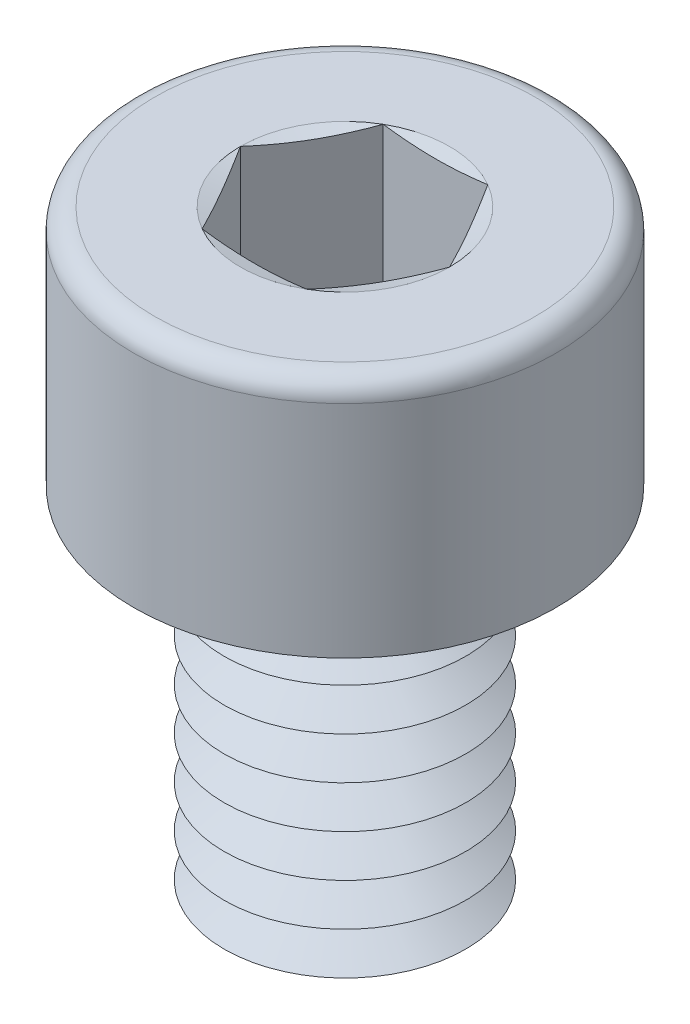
ISO-10303-21;
HEADER;
FILE_DESCRIPTION(('STEP AP214'),'2;1');
FILE_NAME('part.step','',(''),(''),'','','');
FILE_SCHEMA(('AUTOMOTIVE_DESIGN { 1 0 10303 214 1 1 1 1 }'));
ENDSEC;
DATA;
#1=APPLICATION_CONTEXT('core data for automotive mechanical design processes');
#2=APPLICATION_PROTOCOL_DEFINITION('international standard','automotive_design',2000,#1);
#3=PRODUCT_CONTEXT('',#1,'mechanical');
#4=PRODUCT('Part','Part','',(#3));
#5=PRODUCT_RELATED_PRODUCT_CATEGORY('part','',(#4));
#6=PRODUCT_DEFINITION_FORMATION('','',#4);
#7=PRODUCT_DEFINITION_CONTEXT('part definition',#1,'design');
#8=PRODUCT_DEFINITION('design','',#6,#7);
#9=PRODUCT_DEFINITION_SHAPE('','',#8);
#10=(LENGTH_UNIT() NAMED_UNIT(*) SI_UNIT(.MILLI.,.METRE.));
#11=(NAMED_UNIT(*) PLANE_ANGLE_UNIT() SI_UNIT($,.RADIAN.));
#12=(NAMED_UNIT(*) SI_UNIT($,.STERADIAN.) SOLID_ANGLE_UNIT());
#13=UNCERTAINTY_MEASURE_WITH_UNIT(LENGTH_MEASURE(1.E-05),#10,'distance_accuracy_value','');
#14=(GEOMETRIC_REPRESENTATION_CONTEXT(3) GLOBAL_UNCERTAINTY_ASSIGNED_CONTEXT((#13)) GLOBAL_UNIT_ASSIGNED_CONTEXT((#10,
#11,#12)) REPRESENTATION_CONTEXT('',''));
#15=CARTESIAN_POINT('',(0.,0.,0.));
#16=DIRECTION('',(0.,0.,1.));
#17=DIRECTION('',(1.,0.,0.));
#18=AXIS2_PLACEMENT_3D('',#15,#16,#17);
#19=CARTESIAN_POINT('',(0.,2.8,0.));
#20=DIRECTION('',(0.,1.,0.));
#21=DIRECTION('',(0.,0.,1.));
#22=AXIS2_PLACEMENT_3D('',#19,#20,#21);
#23=CONICAL_SURFACE('',#22,1.39378221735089,1.0471975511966);
#24=CARTESIAN_POINT('',(0.,3.15,0.));
#25=DIRECTION('',(0.,1.,0.));
#26=DIRECTION('',(0.,0.,1.));
#27=AXIS2_PLACEMENT_3D('',#24,#25,#26);
#28=CIRCLE('',#27,2.);
#29=CARTESIAN_POINT('',(0.,3.15,2.));
#30=VERTEX_POINT('',#29);
#31=EDGE_CURVE('E383',#30,#30,#28,.T.);
#32=ORIENTED_EDGE('',*,*,#31,.F.);
#33=EDGE_LOOP('',(#32));
#34=FACE_BOUND('',#33,.T.);
#35=CARTESIAN_POINT('',(0.,2.8,0.));
#36=DIRECTION('',(0.,1.,0.));
#37=DIRECTION('',(0.,0.,1.));
#38=AXIS2_PLACEMENT_3D('',#35,#36,#37);
#39=CIRCLE('',#38,1.39378221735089);
#40=CARTESIAN_POINT('',(0.,2.8,1.39378221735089));
#41=VERTEX_POINT('',#40);
#42=EDGE_CURVE('E387',#41,#41,#39,.T.);
#43=ORIENTED_EDGE('',*,*,#42,.T.);
#44=EDGE_LOOP('',(#43));
#45=FACE_BOUND('',#44,.T.);
#46=ADVANCED_FACE('F41',(#34,#45),#23,.T.);
#47=CARTESIAN_POINT('',(0.,2.45,0.));
#48=DIRECTION('',(0.,-1.,0.));
#49=DIRECTION('',(0.,0.,-1.));
#50=AXIS2_PLACEMENT_3D('',#47,#48,#49);
#51=CONICAL_SURFACE('',#50,2.,1.0471975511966);
#52=ORIENTED_EDGE('',*,*,#42,.F.);
#53=EDGE_LOOP('',(#52));
#54=FACE_BOUND('',#53,.T.);
#55=CARTESIAN_POINT('',(0.,2.45,0.));
#56=DIRECTION('',(0.,1.,0.));
#57=DIRECTION('',(0.,0.,1.));
#58=AXIS2_PLACEMENT_3D('',#55,#56,#57);
#59=CIRCLE('',#58,2.);
#60=CARTESIAN_POINT('',(0.,2.45,2.));
#61=VERTEX_POINT('',#60);
#62=EDGE_CURVE('E391',#61,#61,#59,.T.);
#63=ORIENTED_EDGE('',*,*,#62,.T.);
#64=EDGE_LOOP('',(#63));
#65=FACE_BOUND('',#64,.T.);
#66=ADVANCED_FACE('F251',(#54,#65),#51,.T.);
#67=CARTESIAN_POINT('',(0.,0.,0.));
#68=DIRECTION('',(0.,1.,0.));
#69=DIRECTION('',(0.,0.,1.));
#70=AXIS2_PLACEMENT_3D('',#67,#68,#69);
#71=PLANE('',#70);
#72=CARTESIAN_POINT('',(0.,0.,0.));
#73=DIRECTION('',(0.,1.,0.));
#74=DIRECTION('',(0.,0.,1.));
#75=AXIS2_PLACEMENT_3D('',#72,#73,#74);
#76=CIRCLE('',#75,1.39378221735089);
#77=CARTESIAN_POINT('',(0.,0.,1.39378221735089));
#78=VERTEX_POINT('',#77);
#79=EDGE_CURVE('E418',#78,#78,#76,.T.);
#80=ORIENTED_EDGE('',*,*,#79,.F.);
#81=EDGE_LOOP('',(#80));
#82=FACE_BOUND('',#81,.T.);
#83=ADVANCED_FACE('F248',(#82),#71,.F.);
#84=CARTESIAN_POINT('',(0.,0.,0.));
#85=DIRECTION('',(0.,1.,0.));
#86=DIRECTION('',(0.,0.,1.));
#87=AXIS2_PLACEMENT_3D('',#84,#85,#86);
#88=CONICAL_SURFACE('',#87,1.39378221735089,1.0471975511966);
#89=CARTESIAN_POINT('',(0.,0.35,0.));
#90=DIRECTION('',(0.,1.,0.));
#91=DIRECTION('',(0.,0.,1.));
#92=AXIS2_PLACEMENT_3D('',#89,#90,#91);
#93=CIRCLE('',#92,2.);
#94=CARTESIAN_POINT('',(0.,0.35,2.));
#95=VERTEX_POINT('',#94);
#96=EDGE_CURVE('E414',#95,#95,#93,.T.);
#97=ORIENTED_EDGE('',*,*,#96,.F.);
#98=EDGE_LOOP('',(#97));
#99=FACE_BOUND('',#98,.T.);
#100=ORIENTED_EDGE('',*,*,#79,.T.);
#101=EDGE_LOOP('',(#100));
#102=FACE_BOUND('',#101,.T.);
#103=ADVANCED_FACE('F250',(#99,#102),#88,.T.);
#104=CARTESIAN_POINT('',(0.,0.35,0.));
#105=DIRECTION('',(0.,-1.,0.));
#106=DIRECTION('',(0.,0.,-1.));
#107=AXIS2_PLACEMENT_3D('',#104,#105,#106);
#108=CONICAL_SURFACE('',#107,2.,1.0471975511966);
#109=CARTESIAN_POINT('',(0.,0.7,0.));
#110=DIRECTION('',(0.,1.,0.));
#111=DIRECTION('',(0.,0.,1.));
#112=AXIS2_PLACEMENT_3D('',#109,#110,#111);
#113=CIRCLE('',#112,1.39378221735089);
#114=CARTESIAN_POINT('',(0.,0.7,1.39378221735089));
#115=VERTEX_POINT('',#114);
#116=EDGE_CURVE('E410',#115,#115,#113,.T.);
#117=ORIENTED_EDGE('',*,*,#116,.F.);
#118=EDGE_LOOP('',(#117));
#119=FACE_BOUND('',#118,.T.);
#120=ORIENTED_EDGE('',*,*,#96,.T.);
#121=EDGE_LOOP('',(#120));
#122=FACE_BOUND('',#121,.T.);
#123=ADVANCED_FACE('F291',(#119,#122),#108,.T.);
#124=CARTESIAN_POINT('',(0.,0.7,0.));
#125=DIRECTION('',(0.,1.,0.));
#126=DIRECTION('',(0.,0.,1.));
#127=AXIS2_PLACEMENT_3D('',#124,#125,#126);
#128=CONICAL_SURFACE('',#127,1.39378221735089,1.0471975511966);
#129=CARTESIAN_POINT('',(0.,1.05,0.));
#130=DIRECTION('',(0.,1.,0.));
#131=DIRECTION('',(0.,0.,1.));
#132=AXIS2_PLACEMENT_3D('',#129,#130,#131);
#133=CIRCLE('',#132,2.);
#134=CARTESIAN_POINT('',(0.,1.05,2.));
#135=VERTEX_POINT('',#134);
#136=EDGE_CURVE('E406',#135,#135,#133,.T.);
#137=ORIENTED_EDGE('',*,*,#136,.F.);
#138=EDGE_LOOP('',(#137));
#139=FACE_BOUND('',#138,.T.);
#140=ORIENTED_EDGE('',*,*,#116,.T.);
#141=EDGE_LOOP('',(#140));
#142=FACE_BOUND('',#141,.T.);
#143=ADVANCED_FACE('F286',(#139,#142),#128,.T.);
#144=CARTESIAN_POINT('',(0.,1.05,0.));
#145=DIRECTION('',(0.,-1.,0.));
#146=DIRECTION('',(0.,0.,-1.));
#147=AXIS2_PLACEMENT_3D('',#144,#145,#146);
#148=CONICAL_SURFACE('',#147,2.,1.0471975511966);
#149=CARTESIAN_POINT('',(0.,1.4,0.));
#150=DIRECTION('',(0.,1.,0.));
#151=DIRECTION('',(0.,0.,1.));
#152=AXIS2_PLACEMENT_3D('',#149,#150,#151);
#153=CIRCLE('',#152,1.39378221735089);
#154=CARTESIAN_POINT('',(0.,1.4,1.39378221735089));
#155=VERTEX_POINT('',#154);
#156=EDGE_CURVE('E402',#155,#155,#153,.T.);
#157=ORIENTED_EDGE('',*,*,#156,.F.);
#158=EDGE_LOOP('',(#157));
#159=FACE_BOUND('',#158,.T.);
#160=ORIENTED_EDGE('',*,*,#136,.T.);
#161=EDGE_LOOP('',(#160));
#162=FACE_BOUND('',#161,.T.);
#163=ADVANCED_FACE('F283',(#159,#162),#148,.T.);
#164=CARTESIAN_POINT('',(0.,1.4,0.));
#165=DIRECTION('',(0.,1.,0.));
#166=DIRECTION('',(0.,0.,1.));
#167=AXIS2_PLACEMENT_3D('',#164,#165,#166);
#168=CONICAL_SURFACE('',#167,1.39378221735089,1.0471975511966);
#169=CARTESIAN_POINT('',(0.,1.75,0.));
#170=DIRECTION('',(0.,1.,0.));
#171=DIRECTION('',(0.,0.,1.));
#172=AXIS2_PLACEMENT_3D('',#169,#170,#171);
#173=CIRCLE('',#172,2.);
#174=CARTESIAN_POINT('',(0.,1.75,2.));
#175=VERTEX_POINT('',#174);
#176=EDGE_CURVE('E398',#175,#175,#173,.T.);
#177=ORIENTED_EDGE('',*,*,#176,.F.);
#178=EDGE_LOOP('',(#177));
#179=FACE_BOUND('',#178,.T.);
#180=ORIENTED_EDGE('',*,*,#156,.T.);
#181=EDGE_LOOP('',(#180));
#182=FACE_BOUND('',#181,.T.);
#183=ADVANCED_FACE('F277',(#179,#182),#168,.T.);
#184=CARTESIAN_POINT('',(0.,1.75,0.));
#185=DIRECTION('',(0.,-1.,0.));
#186=DIRECTION('',(0.,0.,-1.));
#187=AXIS2_PLACEMENT_3D('',#184,#185,#186);
#188=CONICAL_SURFACE('',#187,2.,1.0471975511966);
#189=CARTESIAN_POINT('',(0.,2.1,0.));
#190=DIRECTION('',(0.,1.,0.));
#191=DIRECTION('',(0.,0.,1.));
#192=AXIS2_PLACEMENT_3D('',#189,#190,#191);
#193=CIRCLE('',#192,1.39378221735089);
#194=CARTESIAN_POINT('',(0.,2.1,1.39378221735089));
#195=VERTEX_POINT('',#194);
#196=EDGE_CURVE('E394',#195,#195,#193,.T.);
#197=ORIENTED_EDGE('',*,*,#196,.F.);
#198=EDGE_LOOP('',(#197));
#199=FACE_BOUND('',#198,.T.);
#200=ORIENTED_EDGE('',*,*,#176,.T.);
#201=EDGE_LOOP('',(#200));
#202=FACE_BOUND('',#201,.T.);
#203=ADVANCED_FACE('F273',(#199,#202),#188,.T.);
#204=CARTESIAN_POINT('',(0.,2.1,0.));
#205=DIRECTION('',(0.,1.,0.));
#206=DIRECTION('',(0.,0.,1.));
#207=AXIS2_PLACEMENT_3D('',#204,#205,#206);
#208=CONICAL_SURFACE('',#207,1.39378221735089,1.0471975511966);
#209=ORIENTED_EDGE('',*,*,#62,.F.);
#210=EDGE_LOOP('',(#209));
#211=FACE_BOUND('',#210,.T.);
#212=ORIENTED_EDGE('',*,*,#196,.T.);
#213=EDGE_LOOP('',(#212));
#214=FACE_BOUND('',#213,.T.);
#215=ADVANCED_FACE('F276',(#211,#214),#208,.T.);
#216=CARTESIAN_POINT('',(0.,3.5,0.));
#217=DIRECTION('',(0.,1.,0.));
#218=DIRECTION('',(0.,0.,1.));
#219=AXIS2_PLACEMENT_3D('',#216,#217,#218);
#220=CONICAL_SURFACE('',#219,1.39378221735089,1.0471975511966);
#221=CARTESIAN_POINT('',(0.,3.85,0.));
#222=DIRECTION('',(0.,1.,0.));
#223=DIRECTION('',(0.,0.,1.));
#224=AXIS2_PLACEMENT_3D('',#221,#222,#223);
#225=CIRCLE('',#224,2.);
#226=CARTESIAN_POINT('',(0.,3.85,2.));
#227=VERTEX_POINT('',#226);
#228=EDGE_CURVE('E375',#227,#227,#225,.T.);
#229=ORIENTED_EDGE('',*,*,#228,.F.);
#230=EDGE_LOOP('',(#229));
#231=FACE_BOUND('',#230,.T.);
#232=CARTESIAN_POINT('',(0.,3.5,0.));
#233=DIRECTION('',(0.,1.,0.));
#234=DIRECTION('',(0.,0.,1.));
#235=AXIS2_PLACEMENT_3D('',#232,#233,#234);
#236=CIRCLE('',#235,1.39378221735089);
#237=CARTESIAN_POINT('',(0.,3.5,1.39378221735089));
#238=VERTEX_POINT('',#237);
#239=EDGE_CURVE('E379',#238,#238,#236,.T.);
#240=ORIENTED_EDGE('',*,*,#239,.T.);
#241=EDGE_LOOP('',(#240));
#242=FACE_BOUND('',#241,.T.);
#243=ADVANCED_FACE('F281',(#231,#242),#220,.T.);
#244=CARTESIAN_POINT('',(0.,3.15,0.));
#245=DIRECTION('',(0.,-1.,0.));
#246=DIRECTION('',(0.,0.,-1.));
#247=AXIS2_PLACEMENT_3D('',#244,#245,#246);
#248=CONICAL_SURFACE('',#247,2.,1.0471975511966);
#249=ORIENTED_EDGE('',*,*,#239,.F.);
#250=EDGE_LOOP('',(#249));
#251=FACE_BOUND('',#250,.T.);
#252=ORIENTED_EDGE('',*,*,#31,.T.);
#253=EDGE_LOOP('',(#252));
#254=FACE_BOUND('',#253,.T.);
#255=ADVANCED_FACE('F619',(#251,#254),#248,.T.);
#256=CARTESIAN_POINT('',(0.,4.2,0.));
#257=DIRECTION('',(0.,1.,0.));
#258=DIRECTION('',(0.,0.,1.));
#259=AXIS2_PLACEMENT_3D('',#256,#257,#258);
#260=CONICAL_SURFACE('',#259,1.39378221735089,1.0471975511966);
#261=CARTESIAN_POINT('',(0.,4.55,0.));
#262=DIRECTION('',(0.,1.,0.));
#263=DIRECTION('',(0.,0.,1.));
#264=AXIS2_PLACEMENT_3D('',#261,#262,#263);
#265=CIRCLE('',#264,2.);
#266=CARTESIAN_POINT('',(0.,4.55,2.));
#267=VERTEX_POINT('',#266);
#268=EDGE_CURVE('E367',#267,#267,#265,.T.);
#269=ORIENTED_EDGE('',*,*,#268,.F.);
#270=EDGE_LOOP('',(#269));
#271=FACE_BOUND('',#270,.T.);
#272=CARTESIAN_POINT('',(0.,4.2,0.));
#273=DIRECTION('',(0.,1.,0.));
#274=DIRECTION('',(0.,0.,1.));
#275=AXIS2_PLACEMENT_3D('',#272,#273,#274);
#276=CIRCLE('',#275,1.39378221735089);
#277=CARTESIAN_POINT('',(0.,4.2,1.39378221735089));
#278=VERTEX_POINT('',#277);
#279=EDGE_CURVE('E371',#278,#278,#276,.T.);
#280=ORIENTED_EDGE('',*,*,#279,.T.);
#281=EDGE_LOOP('',(#280));
#282=FACE_BOUND('',#281,.T.);
#283=ADVANCED_FACE('F610',(#271,#282),#260,.T.);
#284=CARTESIAN_POINT('',(0.,3.85,0.));
#285=DIRECTION('',(0.,-1.,0.));
#286=DIRECTION('',(0.,0.,-1.));
#287=AXIS2_PLACEMENT_3D('',#284,#285,#286);
#288=CONICAL_SURFACE('',#287,2.,1.0471975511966);
#289=ORIENTED_EDGE('',*,*,#279,.F.);
#290=EDGE_LOOP('',(#289));
#291=FACE_BOUND('',#290,.T.);
#292=ORIENTED_EDGE('',*,*,#228,.T.);
#293=EDGE_LOOP('',(#292));
#294=FACE_BOUND('',#293,.T.);
#295=ADVANCED_FACE('F601',(#291,#294),#288,.T.);
#296=CARTESIAN_POINT('',(0.,4.9,0.));
#297=DIRECTION('',(0.,1.,0.));
#298=DIRECTION('',(0.,0.,1.));
#299=AXIS2_PLACEMENT_3D('',#296,#297,#298);
#300=CONICAL_SURFACE('',#299,1.39378221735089,1.0471975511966);
#301=CARTESIAN_POINT('',(0.,5.25,0.));
#302=DIRECTION('',(0.,1.,0.));
#303=DIRECTION('',(0.,0.,1.));
#304=AXIS2_PLACEMENT_3D('',#301,#302,#303);
#305=CIRCLE('',#304,2.);
#306=CARTESIAN_POINT('',(0.,5.25,2.));
#307=VERTEX_POINT('',#306);
#308=EDGE_CURVE('E353',#307,#307,#305,.T.);
#309=ORIENTED_EDGE('',*,*,#308,.F.);
#310=EDGE_LOOP('',(#309));
#311=FACE_BOUND('',#310,.T.);
#312=CARTESIAN_POINT('',(0.,4.9,0.));
#313=DIRECTION('',(0.,1.,0.));
#314=DIRECTION('',(0.,0.,1.));
#315=AXIS2_PLACEMENT_3D('',#312,#313,#314);
#316=CIRCLE('',#315,1.39378221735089);
#317=CARTESIAN_POINT('',(0.,4.9,1.39378221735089));
#318=VERTEX_POINT('',#317);
#319=EDGE_CURVE('E363',#318,#318,#316,.T.);
#320=ORIENTED_EDGE('',*,*,#319,.T.);
#321=EDGE_LOOP('',(#320));
#322=FACE_BOUND('',#321,.T.);
#323=ADVANCED_FACE('F592',(#311,#322),#300,.T.);
#324=CARTESIAN_POINT('',(0.,4.55,0.));
#325=DIRECTION('',(0.,-1.,0.));
#326=DIRECTION('',(0.,0.,-1.));
#327=AXIS2_PLACEMENT_3D('',#324,#325,#326);
#328=CONICAL_SURFACE('',#327,2.,1.0471975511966);
#329=ORIENTED_EDGE('',*,*,#319,.F.);
#330=EDGE_LOOP('',(#329));
#331=FACE_BOUND('',#330,.T.);
#332=ORIENTED_EDGE('',*,*,#268,.T.);
#333=EDGE_LOOP('',(#332));
#334=FACE_BOUND('',#333,.T.);
#335=ADVANCED_FACE('F584',(#331,#334),#328,.T.);
#336=CARTESIAN_POINT('',(0.,5.6,0.));
#337=DIRECTION('',(0.,1.,0.));
#338=DIRECTION('',(0.,0.,1.));
#339=AXIS2_PLACEMENT_3D('',#336,#337,#338);
#340=CONICAL_SURFACE('',#339,1.39378221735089,1.0471975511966);
#341=CARTESIAN_POINT('',(0.,5.95,0.));
#342=DIRECTION('',(0.,1.,0.));
#343=DIRECTION('',(0.,0.,1.));
#344=AXIS2_PLACEMENT_3D('',#341,#342,#343);
#345=CIRCLE('',#344,2.);
#346=CARTESIAN_POINT('',(0.,5.95,2.));
#347=VERTEX_POINT('',#346);
#348=EDGE_CURVE('E358',#347,#347,#345,.T.);
#349=ORIENTED_EDGE('',*,*,#348,.F.);
#350=EDGE_LOOP('',(#349));
#351=FACE_BOUND('',#350,.T.);
#352=CARTESIAN_POINT('',(0.,5.6,0.));
#353=DIRECTION('',(0.,1.,0.));
#354=DIRECTION('',(0.,0.,1.));
#355=AXIS2_PLACEMENT_3D('',#352,#353,#354);
#356=CIRCLE('',#355,1.39378221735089);
#357=CARTESIAN_POINT('',(0.,5.6,1.39378221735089));
#358=VERTEX_POINT('',#357);
#359=EDGE_CURVE('E348',#358,#358,#356,.T.);
#360=ORIENTED_EDGE('',*,*,#359,.T.);
#361=EDGE_LOOP('',(#360));
#362=FACE_BOUND('',#361,.T.);
#363=ADVANCED_FACE('F576',(#351,#362),#340,.T.);
#364=CARTESIAN_POINT('',(0.,5.25,0.));
#365=DIRECTION('',(0.,-1.,0.));
#366=DIRECTION('',(0.,0.,-1.));
#367=AXIS2_PLACEMENT_3D('',#364,#365,#366);
#368=CONICAL_SURFACE('',#367,2.,1.0471975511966);
#369=ORIENTED_EDGE('',*,*,#359,.F.);
#370=EDGE_LOOP('',(#369));
#371=FACE_BOUND('',#370,.T.);
#372=ORIENTED_EDGE('',*,*,#308,.T.);
#373=EDGE_LOOP('',(#372));
#374=FACE_BOUND('',#373,.T.);
#375=ADVANCED_FACE('F195',(#371,#374),#368,.T.);
#376=CARTESIAN_POINT('',(0.,10.,0.));
#377=DIRECTION('',(0.,1.,0.));
#378=DIRECTION('',(0.,0.,1.));
#379=AXIS2_PLACEMENT_3D('',#376,#377,#378);
#380=PLANE('',#379);
#381=CARTESIAN_POINT('',(0.,10.,0.));
#382=DIRECTION('',(0.,1.,0.));
#383=DIRECTION('',(0.,0.,1.));
#384=AXIS2_PLACEMENT_3D('',#381,#382,#383);
#385=CIRCLE('',#384,1.73205080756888);
#386=CARTESIAN_POINT('',(0.866025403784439,10.,1.5));
#387=VERTEX_POINT('',#386);
#388=CARTESIAN_POINT('',(1.73205080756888,10.,0.));
#389=VERTEX_POINT('',#388);
#390=EDGE_CURVE('E121',#387,#389,#385,.T.);
#391=ORIENTED_EDGE('',*,*,#390,.F.);
#392=CARTESIAN_POINT('',(0.,10.,0.));
#393=DIRECTION('',(0.,1.,0.));
#394=DIRECTION('',(0.,0.,1.));
#395=AXIS2_PLACEMENT_3D('',#392,#393,#394);
#396=CIRCLE('',#395,1.73205080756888);
#397=CARTESIAN_POINT('',(-0.866025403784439,10.,1.5));
#398=VERTEX_POINT('',#397);
#399=EDGE_CURVE('E45',#398,#387,#396,.T.);
#400=ORIENTED_EDGE('',*,*,#399,.F.);
#401=CARTESIAN_POINT('',(-1.73205080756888,10.,0.));
#402=VERTEX_POINT('',#401);
#403=EDGE_CURVE('E138',#402,#398,#396,.T.);
#404=ORIENTED_EDGE('',*,*,#403,.F.);
#405=CARTESIAN_POINT('',(-0.866025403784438,10.,-1.5));
#406=VERTEX_POINT('',#405);
#407=EDGE_CURVE('E848',#406,#402,#396,.T.);
#408=ORIENTED_EDGE('',*,*,#407,.F.);
#409=CARTESIAN_POINT('',(0.866025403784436,10.,-1.5));
#410=VERTEX_POINT('',#409);
#411=EDGE_CURVE('E51',#410,#406,#396,.T.);
#412=ORIENTED_EDGE('',*,*,#411,.F.);
#413=EDGE_CURVE('E11',#389,#410,#396,.T.);
#414=ORIENTED_EDGE('',*,*,#413,.F.);
#415=EDGE_LOOP('',(#391,#400,#404,#408,#412,#414));
#416=FACE_BOUND('',#415,.T.);
#417=CARTESIAN_POINT('',(0.,10.,0.));
#418=DIRECTION('',(0.,1.,0.));
#419=DIRECTION('',(0.,0.,1.));
#420=AXIS2_PLACEMENT_3D('',#417,#418,#419);
#421=CIRCLE('',#420,3.15);
#422=CARTESIAN_POINT('',(0.,10.,3.15));
#423=VERTEX_POINT('',#422);
#424=EDGE_CURVE('E462',#423,#423,#421,.T.);
#425=ORIENTED_EDGE('',*,*,#424,.T.);
#426=EDGE_LOOP('',(#425));
#427=FACE_BOUND('',#426,.T.);
#428=ADVANCED_FACE('F140',(#416,#427),#380,.T.);
#429=CARTESIAN_POINT('',(0.,9.65,0.));
#430=DIRECTION('',(0.,1.,0.));
#431=DIRECTION('',(0.,0.,1.));
#432=AXIS2_PLACEMENT_3D('',#429,#430,#431);
#433=TOROIDAL_SURFACE('',#432,3.15,0.35);
#434=CARTESIAN_POINT('',(0.,9.65,0.));
#435=DIRECTION('',(0.,1.,0.));
#436=DIRECTION('',(0.,0.,1.));
#437=AXIS2_PLACEMENT_3D('',#434,#435,#436);
#438=CIRCLE('',#437,3.5);
#439=CARTESIAN_POINT('',(0.,9.65,3.5));
#440=VERTEX_POINT('',#439);
#441=EDGE_CURVE('E466',#440,#440,#438,.F.);
#442=ORIENTED_EDGE('',*,*,#441,.F.);
#443=EDGE_LOOP('',(#442));
#444=FACE_BOUND('',#443,.T.);
#445=ORIENTED_EDGE('',*,*,#424,.F.);
#446=EDGE_LOOP('',(#445));
#447=FACE_BOUND('',#446,.T.);
#448=ADVANCED_FACE('F43',(#444,#447),#433,.T.);
#449=CARTESIAN_POINT('',(0.,10.,0.));
#450=DIRECTION('',(0.,-1.,0.));
#451=DIRECTION('',(0.,0.,-1.));
#452=AXIS2_PLACEMENT_3D('',#449,#450,#451);
#453=CYLINDRICAL_SURFACE('',#452,3.5);
#454=ORIENTED_EDGE('',*,*,#441,.T.);
#455=EDGE_LOOP('',(#454));
#456=FACE_BOUND('',#455,.T.);
#457=CARTESIAN_POINT('',(0.,6.,0.));
#458=DIRECTION('',(0.,1.,0.));
#459=DIRECTION('',(0.,0.,1.));
#460=AXIS2_PLACEMENT_3D('',#457,#458,#459);
#461=CIRCLE('',#460,3.5);
#462=CARTESIAN_POINT('',(0.,6.,3.5));
#463=VERTEX_POINT('',#462);
#464=EDGE_CURVE('E449',#463,#463,#461,.T.);
#465=ORIENTED_EDGE('',*,*,#464,.T.);
#466=EDGE_LOOP('',(#465));
#467=FACE_BOUND('',#466,.T.);
#468=ADVANCED_FACE('F243',(#456,#467),#453,.T.);
#469=CARTESIAN_POINT('',(0.,6.,0.));
#470=DIRECTION('',(0.,1.,0.));
#471=DIRECTION('',(0.,0.,1.));
#472=AXIS2_PLACEMENT_3D('',#469,#470,#471);
#473=PLANE('',#472);
#474=ORIENTED_EDGE('',*,*,#464,.F.);
#475=EDGE_LOOP('',(#474));
#476=FACE_BOUND('',#475,.T.);
#477=CARTESIAN_POINT('',(0.,6.,0.));
#478=DIRECTION('',(0.,1.,0.));
#479=DIRECTION('',(0.,0.,1.));
#480=AXIS2_PLACEMENT_3D('',#477,#478,#479);
#481=CIRCLE('',#480,2.);
#482=CARTESIAN_POINT('',(0.,6.,2.));
#483=VERTEX_POINT('',#482);
#484=EDGE_CURVE('E458',#483,#483,#481,.T.);
#485=ORIENTED_EDGE('',*,*,#484,.T.);
#486=EDGE_LOOP('',(#485));
#487=FACE_BOUND('',#486,.T.);
#488=ADVANCED_FACE('F239',(#476,#487),#473,.F.);
#489=CARTESIAN_POINT('',(0.,6.,0.));
#490=DIRECTION('',(0.,-1.,0.));
#491=DIRECTION('',(0.,0.,-1.));
#492=AXIS2_PLACEMENT_3D('',#489,#490,#491);
#493=CYLINDRICAL_SURFACE('',#492,2.);
#494=ORIENTED_EDGE('',*,*,#348,.T.);
#495=EDGE_LOOP('',(#494));
#496=FACE_BOUND('',#495,.T.);
#497=ORIENTED_EDGE('',*,*,#484,.F.);
#498=EDGE_LOOP('',(#497));
#499=FACE_BOUND('',#498,.T.);
#500=ADVANCED_FACE('F242',(#496,#499),#493,.T.);
#501=CARTESIAN_POINT('',(0.,10.,0.));
#502=DIRECTION('',(0.,1.,0.));
#503=DIRECTION('',(0.,0.,1.));
#504=AXIS2_PLACEMENT_3D('',#501,#502,#503);
#505=CONICAL_SURFACE('',#504,1.73205080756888,1.30899693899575);
#506=ORIENTED_EDGE('',*,*,#399,.T.);
#507=CARTESIAN_POINT('',(-2.26080568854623,10.2628876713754,1.5));
#508=CARTESIAN_POINT('',(-2.19307335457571,10.247767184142,1.5));
#509=CARTESIAN_POINT('',(-2.12529797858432,10.2328393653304,1.5));
#510=CARTESIAN_POINT('',(-1.98963961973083,10.203466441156,1.5));
#511=CARTESIAN_POINT('',(-1.92175663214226,10.1890213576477,1.5));
#512=CARTESIAN_POINT('',(-1.71778516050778,10.146529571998,1.5));
#513=CARTESIAN_POINT('',(-1.58151166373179,10.1193574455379,1.5));
#514=CARTESIAN_POINT('',(-1.30947840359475,10.0687885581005,1.5));
#515=CARTESIAN_POINT('',(-1.17372447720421,10.0453610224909,1.5));
#516=CARTESIAN_POINT('',(-0.901404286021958,10.0038503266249,1.5));
#517=CARTESIAN_POINT('',(-0.764838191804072,9.98576608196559,1.5));
#518=CARTESIAN_POINT('',(-0.48929318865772,9.95729203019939,1.5));
#519=CARTESIAN_POINT('',(-0.350304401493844,9.94699084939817,1.5));
#520=CARTESIAN_POINT('',(-0.141571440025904,9.93918165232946,1.5));
#521=CARTESIAN_POINT('',(-0.0719628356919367,9.93785196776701,1.5));
#522=CARTESIAN_POINT('',(0.0672555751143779,9.93779336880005,1.5));
#523=CARTESIAN_POINT('',(0.136865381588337,9.9390644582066,1.5));
#524=CARTESIAN_POINT('',(0.346114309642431,9.9467225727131,1.5));
#525=CARTESIAN_POINT('',(0.485619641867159,9.95697478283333,1.5));
#526=CARTESIAN_POINT('',(0.763829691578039,9.98560011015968,1.5));
#527=CARTESIAN_POINT('',(0.902533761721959,10.0039790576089,1.5));
#528=CARTESIAN_POINT('',(1.18270277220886,10.0467752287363,1.5));
#529=CARTESIAN_POINT('',(1.32414472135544,10.0713381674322,1.5));
#530=CARTESIAN_POINT('',(1.60634089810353,10.1241771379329,1.5));
#531=CARTESIAN_POINT('',(1.7470950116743,10.1524537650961,1.5));
#532=CARTESIAN_POINT('',(2.02813528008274,10.2114128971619,1.5));
#533=CARTESIAN_POINT('',(2.16842128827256,10.2420960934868,1.5));
#534=CARTESIAN_POINT('',(2.4486355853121,10.3050575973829,1.5));
#535=CARTESIAN_POINT('',(2.58856386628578,10.3373359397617,1.5));
#536=CARTESIAN_POINT('',(2.86645602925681,10.4025869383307,1.5));
#537=CARTESIAN_POINT('',(3.00442304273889,10.435546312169,1.5));
#538=CARTESIAN_POINT('',(3.28017563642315,10.5022271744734,1.5));
#539=CARTESIAN_POINT('',(3.41796121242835,10.5359486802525,1.5));
#540=CARTESIAN_POINT('',(3.69320305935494,10.6038996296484,1.5));
#541=CARTESIAN_POINT('',(3.83065952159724,10.6381282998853,1.5));
#542=CARTESIAN_POINT('',(4.10546119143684,10.7070087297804,1.5));
#543=CARTESIAN_POINT('',(4.24280640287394,10.7416604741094,1.5));
#544=CARTESIAN_POINT('',(4.38011382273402,10.7764596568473,1.5));
#545=B_SPLINE_CURVE_WITH_KNOTS('',3,(#507,#508,#509,#510,#511,#512,#513,#514,#515,#516,#517,
#518,#519,#520,#521,#522,#523,#524,#525,#526,#527,#528,#529,#530,#531,#532,#533,#534,#535,#536,
#537,#538,#539,#540,#541,#542,#543,#544),.UNSPECIFIED.,.F.,.F.,(4,2,2,2,2,2,2,2,2,2,2,2,2,2,2,2,
2,2,4),(0.,0.208198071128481,0.416405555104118,0.833243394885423,1.24645656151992,
1.65958581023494,2.07735129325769,2.28617008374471,2.49498918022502,2.91428402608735,
3.33388016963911,3.76448033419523,4.19514961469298,4.62594308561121,5.05674596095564,
5.48229088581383,5.90784548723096,6.33280701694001,6.75775319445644),.UNSPECIFIED.);
#546=EDGE_CURVE('E127',#398,#387,#545,.T.);
#547=ORIENTED_EDGE('',*,*,#546,.F.);
#548=EDGE_LOOP('',(#506,#547));
#549=FACE_BOUND('',#548,.T.);
#550=ADVANCED_FACE('F132',(#549),#505,.F.);
#551=ORIENTED_EDGE('',*,*,#403,.T.);
#552=CARTESIAN_POINT('',(-1.73216627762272,10.0000309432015,-0.000200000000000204));
#553=CARTESIAN_POINT('',(-1.69619286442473,9.99038632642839,0.0621077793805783));
#554=CARTESIAN_POINT('',(-1.66015421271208,9.98163049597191,0.124528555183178));
#555=CARTESIAN_POINT('',(-1.58794959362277,9.96624719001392,0.249590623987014));
#556=CARTESIAN_POINT('',(-1.55178358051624,9.9596205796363,0.312231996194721));
#557=CARTESIAN_POINT('',(-1.47954358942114,9.94888268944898,0.437355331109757));
#558=CARTESIAN_POINT('',(-1.44347010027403,9.94475860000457,0.499836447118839));
#559=CARTESIAN_POINT('',(-1.37127710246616,9.93922860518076,0.624878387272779));
#560=CARTESIAN_POINT('',(-1.33515760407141,9.93782217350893,0.687439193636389));
#561=CARTESIAN_POINT('',(-1.26291860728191,9.93782217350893,0.81256080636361));
#562=CARTESIAN_POINT('',(-1.22679910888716,9.93922860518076,0.87512161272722));
#563=CARTESIAN_POINT('',(-1.15460611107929,9.94475860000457,1.00016355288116));
#564=CARTESIAN_POINT('',(-1.11853262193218,9.94888268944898,1.06264466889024));
#565=CARTESIAN_POINT('',(-1.04629263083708,9.9596205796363,1.18776800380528));
#566=CARTESIAN_POINT('',(-1.01012661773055,9.96624719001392,1.25040937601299));
#567=CARTESIAN_POINT('',(-0.937921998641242,9.98163049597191,1.37547144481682));
#568=CARTESIAN_POINT('',(-0.901883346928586,9.99038632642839,1.43789222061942));
#569=CARTESIAN_POINT('',(-0.865909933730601,10.0000309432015,1.5002));
#570=B_SPLINE_CURVE_WITH_KNOTS('',3,(#552,#553,#554,#555,#556,#557,#558,#559,#560,#561,#562,
#563,#564,#565,#566,#567,#568,#569),.UNSPECIFIED.,.F.,.F.,(4,2,2,2,2,2,2,2,4),(0.,
0.217782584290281,0.435653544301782,0.652399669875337,0.869103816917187,1.08580796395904,
1.30255408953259,1.52042504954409,1.73820763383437),.UNSPECIFIED.);
#571=EDGE_CURVE('E163',#402,#398,#570,.T.);
#572=ORIENTED_EDGE('',*,*,#571,.F.);
#573=EDGE_LOOP('',(#551,#572));
#574=FACE_BOUND('',#573,.T.);
#575=ADVANCED_FACE('F258',(#574),#505,.F.);
#576=ORIENTED_EDGE('',*,*,#407,.T.);
#577=CARTESIAN_POINT('',(-0.865909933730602,10.0000309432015,-1.5002));
#578=CARTESIAN_POINT('',(-0.901883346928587,9.99038632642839,-1.43789222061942));
#579=CARTESIAN_POINT('',(-0.937921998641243,9.98163049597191,-1.37547144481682));
#580=CARTESIAN_POINT('',(-1.01012661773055,9.96624719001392,-1.25040937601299));
#581=CARTESIAN_POINT('',(-1.04629263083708,9.9596205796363,-1.18776800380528));
#582=CARTESIAN_POINT('',(-1.11853262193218,9.94888268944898,-1.06264466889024));
#583=CARTESIAN_POINT('',(-1.15460611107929,9.94475860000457,-1.00016355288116));
#584=CARTESIAN_POINT('',(-1.22679910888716,9.93922860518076,-0.875121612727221));
#585=CARTESIAN_POINT('',(-1.26291860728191,9.93782217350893,-0.81256080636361));
#586=CARTESIAN_POINT('',(-1.33515760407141,9.93782217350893,-0.687439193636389));
#587=CARTESIAN_POINT('',(-1.37127710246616,9.93922860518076,-0.624878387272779));
#588=CARTESIAN_POINT('',(-1.44347010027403,9.94475860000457,-0.499836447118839));
#589=CARTESIAN_POINT('',(-1.47954358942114,9.94888268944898,-0.437355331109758));
#590=CARTESIAN_POINT('',(-1.55178358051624,9.9596205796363,-0.312231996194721));
#591=CARTESIAN_POINT('',(-1.58794959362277,9.96624719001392,-0.249590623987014));
#592=CARTESIAN_POINT('',(-1.66015421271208,9.98163049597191,-0.124528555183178));
#593=CARTESIAN_POINT('',(-1.69619286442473,9.99038632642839,-0.0621077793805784));
#594=CARTESIAN_POINT('',(-1.73216627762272,10.0000309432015,0.000199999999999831));
#595=B_SPLINE_CURVE_WITH_KNOTS('',3,(#577,#578,#579,#580,#581,#582,#583,#584,#585,#586,#587,
#588,#589,#590,#591,#592,#593,#594),.UNSPECIFIED.,.F.,.F.,(4,2,2,2,2,2,2,2,4),(0.,
0.217782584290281,0.435653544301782,0.652399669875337,0.869103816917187,1.08580796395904,
1.30255408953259,1.52042504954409,1.73820763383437),.UNSPECIFIED.);
#596=EDGE_CURVE('E63',#406,#402,#595,.T.);
#597=ORIENTED_EDGE('',*,*,#596,.F.);
#598=EDGE_LOOP('',(#576,#597));
#599=FACE_BOUND('',#598,.T.);
#600=ADVANCED_FACE('F193',(#599),#505,.F.);
#601=ORIENTED_EDGE('',*,*,#411,.T.);
#602=CARTESIAN_POINT('',(-2.26080568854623,10.2628876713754,-1.5));
#603=CARTESIAN_POINT('',(-2.19307335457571,10.247767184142,-1.5));
#604=CARTESIAN_POINT('',(-2.12529797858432,10.2328393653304,-1.5));
#605=CARTESIAN_POINT('',(-1.98963961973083,10.203466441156,-1.5));
#606=CARTESIAN_POINT('',(-1.92175663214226,10.1890213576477,-1.5));
#607=CARTESIAN_POINT('',(-1.71778516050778,10.146529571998,-1.5));
#608=CARTESIAN_POINT('',(-1.58151166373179,10.1193574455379,-1.5));
#609=CARTESIAN_POINT('',(-1.30947840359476,10.0687885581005,-1.5));
#610=CARTESIAN_POINT('',(-1.17372447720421,10.0453610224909,-1.5));
#611=CARTESIAN_POINT('',(-0.901404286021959,10.0038503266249,-1.5));
#612=CARTESIAN_POINT('',(-0.764838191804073,9.98576608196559,-1.5));
#613=CARTESIAN_POINT('',(-0.489293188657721,9.95729203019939,-1.5));
#614=CARTESIAN_POINT('',(-0.350304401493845,9.94699084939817,-1.5));
#615=CARTESIAN_POINT('',(-0.141571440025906,9.93918165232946,-1.5));
#616=CARTESIAN_POINT('',(-0.0719628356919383,9.93785196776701,-1.5));
#617=CARTESIAN_POINT('',(0.0672555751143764,9.93779336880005,-1.5));
#618=CARTESIAN_POINT('',(0.136865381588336,9.9390644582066,-1.5));
#619=CARTESIAN_POINT('',(0.34611430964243,9.9467225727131,-1.5));
#620=CARTESIAN_POINT('',(0.485619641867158,9.95697478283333,-1.5));
#621=CARTESIAN_POINT('',(0.763829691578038,9.98560011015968,-1.5));
#622=CARTESIAN_POINT('',(0.902533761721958,10.0039790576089,-1.5));
#623=CARTESIAN_POINT('',(1.18270277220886,10.0467752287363,-1.5));
#624=CARTESIAN_POINT('',(1.32414472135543,10.0713381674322,-1.5));
#625=CARTESIAN_POINT('',(1.60634089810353,10.1241771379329,-1.5));
#626=CARTESIAN_POINT('',(1.7470950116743,10.1524537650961,-1.5));
#627=CARTESIAN_POINT('',(2.02813528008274,10.2114128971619,-1.5));
#628=CARTESIAN_POINT('',(2.16842128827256,10.2420960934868,-1.5));
#629=CARTESIAN_POINT('',(2.4486355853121,10.3050575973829,-1.5));
#630=CARTESIAN_POINT('',(2.58856386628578,10.3373359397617,-1.5));
#631=CARTESIAN_POINT('',(2.86645602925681,10.4025869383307,-1.5));
#632=CARTESIAN_POINT('',(3.00442304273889,10.435546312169,-1.5));
#633=CARTESIAN_POINT('',(3.28017563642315,10.5022271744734,-1.5));
#634=CARTESIAN_POINT('',(3.41796121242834,10.5359486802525,-1.5));
#635=CARTESIAN_POINT('',(3.69320305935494,10.6038996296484,-1.5));
#636=CARTESIAN_POINT('',(3.83065952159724,10.6381282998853,-1.5));
#637=CARTESIAN_POINT('',(4.10546119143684,10.7070087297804,-1.5));
#638=CARTESIAN_POINT('',(4.24280640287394,10.7416604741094,-1.5));
#639=CARTESIAN_POINT('',(4.38011382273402,10.7764596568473,-1.5));
#640=B_SPLINE_CURVE_WITH_KNOTS('',3,(#602,#603,#604,#605,#606,#607,#608,#609,#610,#611,#612,
#613,#614,#615,#616,#617,#618,#619,#620,#621,#622,#623,#624,#625,#626,#627,#628,#629,#630,#631,
#632,#633,#634,#635,#636,#637,#638,#639),.UNSPECIFIED.,.F.,.F.,(4,2,2,2,2,2,2,2,2,2,2,2,2,2,2,2,
2,2,4),(0.,0.20819807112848,0.416405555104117,0.833243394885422,1.24645656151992,
1.65958581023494,2.07735129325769,2.28617008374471,2.49498918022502,2.91428402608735,
3.33388016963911,3.76448033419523,4.19514961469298,4.62594308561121,5.05674596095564,
5.48229088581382,5.90784548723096,6.33280701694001,6.75775319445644),.UNSPECIFIED.);
#641=EDGE_CURVE('E214',#410,#406,#640,.F.);
#642=ORIENTED_EDGE('',*,*,#641,.F.);
#643=EDGE_LOOP('',(#601,#642));
#644=FACE_BOUND('',#643,.T.);
#645=ADVANCED_FACE('F188',(#644),#505,.F.);
#646=ORIENTED_EDGE('',*,*,#413,.T.);
#647=CARTESIAN_POINT('',(1.73216627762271,10.0000309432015,0.000200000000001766));
#648=CARTESIAN_POINT('',(1.69619286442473,9.99038632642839,-0.0621077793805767));
#649=CARTESIAN_POINT('',(1.66015421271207,9.98163049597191,-0.124528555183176));
#650=CARTESIAN_POINT('',(1.58794959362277,9.96624719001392,-0.249590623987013));
#651=CARTESIAN_POINT('',(1.55178358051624,9.9596205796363,-0.31223199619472));
#652=CARTESIAN_POINT('',(1.47954358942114,9.94888268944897,-0.437355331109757));
#653=CARTESIAN_POINT('',(1.44347010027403,9.94475860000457,-0.499836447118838));
#654=CARTESIAN_POINT('',(1.37127710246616,9.93922860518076,-0.624878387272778));
#655=CARTESIAN_POINT('',(1.33515760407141,9.93782217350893,-0.687439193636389));
#656=CARTESIAN_POINT('',(1.26291860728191,9.93782217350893,-0.81256080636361));
#657=CARTESIAN_POINT('',(1.22679910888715,9.93922860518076,-0.87512161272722));
#658=CARTESIAN_POINT('',(1.15460611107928,9.94475860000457,-1.00016355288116));
#659=CARTESIAN_POINT('',(1.11853262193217,9.94888268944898,-1.06264466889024));
#660=CARTESIAN_POINT('',(1.04629263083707,9.9596205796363,-1.18776800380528));
#661=CARTESIAN_POINT('',(1.01012661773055,9.96624719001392,-1.25040937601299));
#662=CARTESIAN_POINT('',(0.937921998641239,9.98163049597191,-1.37547144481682));
#663=CARTESIAN_POINT('',(0.901883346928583,9.99038632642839,-1.43789222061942));
#664=CARTESIAN_POINT('',(0.865909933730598,10.0000309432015,-1.5002));
#665=B_SPLINE_CURVE_WITH_KNOTS('',3,(#647,#648,#649,#650,#651,#652,#653,#654,#655,#656,#657,
#658,#659,#660,#661,#662,#663,#664),.UNSPECIFIED.,.F.,.F.,(4,2,2,2,2,2,2,2,4),(0.,
0.217782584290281,0.435653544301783,0.652399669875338,0.869103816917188,1.08580796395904,
1.30255408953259,1.52042504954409,1.73820763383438),.UNSPECIFIED.);
#666=EDGE_CURVE('E56',#389,#410,#665,.T.);
#667=ORIENTED_EDGE('',*,*,#666,.F.);
#668=EDGE_LOOP('',(#646,#667));
#669=FACE_BOUND('',#668,.T.);
#670=ADVANCED_FACE('F192',(#669),#505,.F.);
#671=ORIENTED_EDGE('',*,*,#390,.T.);
#672=CARTESIAN_POINT('',(0.865909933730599,10.0000309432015,1.5002));
#673=CARTESIAN_POINT('',(0.901883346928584,9.99038632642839,1.43789222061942));
#674=CARTESIAN_POINT('',(0.93792199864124,9.98163049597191,1.37547144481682));
#675=CARTESIAN_POINT('',(1.01012661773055,9.96624719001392,1.25040937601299));
#676=CARTESIAN_POINT('',(1.04629263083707,9.9596205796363,1.18776800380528));
#677=CARTESIAN_POINT('',(1.11853262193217,9.94888268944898,1.06264466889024));
#678=CARTESIAN_POINT('',(1.15460611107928,9.94475860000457,1.00016355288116));
#679=CARTESIAN_POINT('',(1.22679910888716,9.93922860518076,0.875121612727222));
#680=CARTESIAN_POINT('',(1.26291860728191,9.93782217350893,0.812560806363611));
#681=CARTESIAN_POINT('',(1.33515760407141,9.93782217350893,0.68743919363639));
#682=CARTESIAN_POINT('',(1.37127710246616,9.93922860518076,0.62487838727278));
#683=CARTESIAN_POINT('',(1.44347010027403,9.94475860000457,0.49983644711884));
#684=CARTESIAN_POINT('',(1.47954358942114,9.94888268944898,0.437355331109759));
#685=CARTESIAN_POINT('',(1.55178358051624,9.9596205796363,0.312231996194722));
#686=CARTESIAN_POINT('',(1.58794959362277,9.96624719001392,0.249590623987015));
#687=CARTESIAN_POINT('',(1.66015421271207,9.98163049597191,0.124528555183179));
#688=CARTESIAN_POINT('',(1.69619286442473,9.99038632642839,0.0621077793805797));
#689=CARTESIAN_POINT('',(1.73216627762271,10.0000309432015,-0.000199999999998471));
#690=B_SPLINE_CURVE_WITH_KNOTS('',3,(#672,#673,#674,#675,#676,#677,#678,#679,#680,#681,#682,
#683,#684,#685,#686,#687,#688,#689),.UNSPECIFIED.,.F.,.F.,(4,2,2,2,2,2,2,2,4),(0.,
0.217782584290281,0.435653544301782,0.652399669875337,0.869103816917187,1.08580796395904,
1.30255408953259,1.52042504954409,1.73820763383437),.UNSPECIFIED.);
#691=EDGE_CURVE('E117',#387,#389,#690,.T.);
#692=ORIENTED_EDGE('',*,*,#691,.F.);
#693=EDGE_LOOP('',(#671,#692));
#694=FACE_BOUND('',#693,.T.);
#695=ADVANCED_FACE('F119',(#694),#505,.F.);
#696=CARTESIAN_POINT('',(0.,7.,0.));
#697=DIRECTION('',(0.,1.,0.));
#698=DIRECTION('',(0.,0.,1.));
#699=AXIS2_PLACEMENT_3D('',#696,#697,#698);
#700=CONICAL_SURFACE('',#699,1.5,1.0471975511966);
#701=CARTESIAN_POINT('',(0.,6.13397459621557,0.));
#702=VERTEX_POINT('',#701);
#703=VERTEX_LOOP('',#702);
#704=FACE_BOUND('',#703,.T.);
#705=CARTESIAN_POINT('',(0.,7.,0.));
#706=DIRECTION('',(0.,1.,0.));
#707=DIRECTION('',(0.,0.,1.));
#708=AXIS2_PLACEMENT_3D('',#705,#706,#707);
#709=CIRCLE('',#708,1.5);
#710=CARTESIAN_POINT('',(0.,7.,1.5));
#711=VERTEX_POINT('',#710);
#712=CARTESIAN_POINT('',(1.29903810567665,7.,0.750000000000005));
#713=VERTEX_POINT('',#712);
#714=EDGE_CURVE('E422',#711,#713,#709,.T.);
#715=ORIENTED_EDGE('',*,*,#714,.T.);
#716=CARTESIAN_POINT('',(0.,7.,0.));
#717=DIRECTION('',(0.,1.,0.));
#718=DIRECTION('',(0.,0.,1.));
#719=AXIS2_PLACEMENT_3D('',#716,#717,#718);
#720=CIRCLE('',#719,1.49999999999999);
#721=CARTESIAN_POINT('',(1.29903810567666,7.,-0.749999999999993));
#722=VERTEX_POINT('',#721);
#723=EDGE_CURVE('E139',#713,#722,#720,.T.);
#724=ORIENTED_EDGE('',*,*,#723,.T.);
#725=CARTESIAN_POINT('',(0.,7.00000000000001,-1.5));
#726=VERTEX_POINT('',#725);
#727=EDGE_CURVE('E478',#722,#726,#720,.T.);
#728=ORIENTED_EDGE('',*,*,#727,.T.);
#729=CARTESIAN_POINT('',(-1.29903810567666,7.,-0.749999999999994));
#730=VERTEX_POINT('',#729);
#731=EDGE_CURVE('E476',#726,#730,#720,.T.);
#732=ORIENTED_EDGE('',*,*,#731,.T.);
#733=CARTESIAN_POINT('',(-1.29903810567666,7.,0.750000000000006));
#734=VERTEX_POINT('',#733);
#735=EDGE_CURVE('E471',#730,#734,#720,.T.);
#736=ORIENTED_EDGE('',*,*,#735,.T.);
#737=EDGE_CURVE('E469',#734,#711,#720,.T.);
#738=ORIENTED_EDGE('',*,*,#737,.T.);
#739=EDGE_LOOP('',(#715,#724,#728,#732,#736,#738));
#740=FACE_BOUND('',#739,.T.);
#741=ADVANCED_FACE('F301',(#704,#740),#700,.F.);
#742=CARTESIAN_POINT('',(0.866025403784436,7.,-1.5));
#743=DIRECTION('',(0.,1.,0.));
#744=DIRECTION('',(0.,0.,1.));
#745=AXIS2_PLACEMENT_3D('',#742,#743,#744);
#746=PLANE('',#745);
#747=ORIENTED_EDGE('',*,*,#731,.F.);
#748=DIRECTION('',(-1.,0.,0.));
#749=VECTOR('',#748,1.);
#750=CARTESIAN_POINT('',(0.866025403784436,7.,-1.5));
#751=LINE('',#750,#749);
#752=CARTESIAN_POINT('',(-0.86602540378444,7.,-1.5));
#753=VERTEX_POINT('',#752);
#754=EDGE_CURVE('E429',#726,#753,#751,.T.);
#755=ORIENTED_EDGE('',*,*,#754,.T.);
#756=DIRECTION('',(-0.5,0.,0.866025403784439));
#757=VECTOR('',#756,1.);
#758=CARTESIAN_POINT('',(-0.86602540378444,7.,-1.5));
#759=LINE('',#758,#757);
#760=EDGE_CURVE('E338',#753,#730,#759,.T.);
#761=ORIENTED_EDGE('',*,*,#760,.T.);
#762=EDGE_LOOP('',(#747,#755,#761));
#763=FACE_BOUND('',#762,.T.);
#764=ADVANCED_FACE('F304',(#763),#746,.T.);
#765=ORIENTED_EDGE('',*,*,#735,.F.);
#766=CARTESIAN_POINT('',(-1.73205080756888,7.,0.));
#767=VERTEX_POINT('',#766);
#768=EDGE_CURVE('E434',#730,#767,#759,.T.);
#769=ORIENTED_EDGE('',*,*,#768,.T.);
#770=DIRECTION('',(0.5,0.,0.866025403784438));
#771=VECTOR('',#770,1.);
#772=CARTESIAN_POINT('',(-1.73205080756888,7.,0.));
#773=LINE('',#772,#771);
#774=EDGE_CURVE('E328',#767,#734,#773,.T.);
#775=ORIENTED_EDGE('',*,*,#774,.T.);
#776=EDGE_LOOP('',(#765,#769,#775));
#777=FACE_BOUND('',#776,.T.);
#778=ADVANCED_FACE('F309',(#777),#746,.T.);
#779=ORIENTED_EDGE('',*,*,#737,.F.);
#780=CARTESIAN_POINT('',(-0.866025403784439,7.,1.5));
#781=VERTEX_POINT('',#780);
#782=EDGE_CURVE('E437',#734,#781,#773,.T.);
#783=ORIENTED_EDGE('',*,*,#782,.T.);
#784=DIRECTION('',(1.,0.,0.));
#785=VECTOR('',#784,1.);
#786=CARTESIAN_POINT('',(-0.866025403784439,7.,1.5));
#787=LINE('',#786,#785);
#788=EDGE_CURVE('E441',#781,#711,#787,.T.);
#789=ORIENTED_EDGE('',*,*,#788,.T.);
#790=EDGE_LOOP('',(#779,#783,#789));
#791=FACE_BOUND('',#790,.T.);
#792=ADVANCED_FACE('F306',(#791),#746,.T.);
#793=ORIENTED_EDGE('',*,*,#714,.F.);
#794=CARTESIAN_POINT('',(0.866025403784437,7.,1.5));
#795=VERTEX_POINT('',#794);
#796=EDGE_CURVE('E440',#711,#795,#787,.T.);
#797=ORIENTED_EDGE('',*,*,#796,.T.);
#798=DIRECTION('',(0.5,0.,-0.866025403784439));
#799=VECTOR('',#798,1.);
#800=CARTESIAN_POINT('',(0.866025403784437,7.,1.5));
#801=LINE('',#800,#799);
#802=EDGE_CURVE('E151',#795,#713,#801,.T.);
#803=ORIENTED_EDGE('',*,*,#802,.T.);
#804=EDGE_LOOP('',(#793,#797,#803));
#805=FACE_BOUND('',#804,.T.);
#806=ADVANCED_FACE('F308',(#805),#746,.T.);
#807=ORIENTED_EDGE('',*,*,#723,.F.);
#808=CARTESIAN_POINT('',(1.73205080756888,7.,0.));
#809=VERTEX_POINT('',#808);
#810=EDGE_CURVE('E445',#713,#809,#801,.T.);
#811=ORIENTED_EDGE('',*,*,#810,.T.);
#812=DIRECTION('',(-0.5,0.,-0.866025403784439));
#813=VECTOR('',#812,1.);
#814=CARTESIAN_POINT('',(1.73205080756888,7.,0.));
#815=LINE('',#814,#813);
#816=EDGE_CURVE('E425',#809,#722,#815,.T.);
#817=ORIENTED_EDGE('',*,*,#816,.T.);
#818=EDGE_LOOP('',(#807,#811,#817));
#819=FACE_BOUND('',#818,.T.);
#820=ADVANCED_FACE('F499',(#819),#746,.T.);
#821=ORIENTED_EDGE('',*,*,#727,.F.);
#822=CARTESIAN_POINT('',(0.866025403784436,7.,-1.5));
#823=VERTEX_POINT('',#822);
#824=EDGE_CURVE('E424',#722,#823,#815,.T.);
#825=ORIENTED_EDGE('',*,*,#824,.T.);
#826=EDGE_CURVE('E430',#823,#726,#751,.T.);
#827=ORIENTED_EDGE('',*,*,#826,.T.);
#828=EDGE_LOOP('',(#821,#825,#827));
#829=FACE_BOUND('',#828,.T.);
#830=ADVANCED_FACE('F235',(#829),#746,.T.);
#831=CARTESIAN_POINT('',(1.73205080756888,7.,0.));
#832=DIRECTION('',(0.866025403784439,0.,-0.5));
#833=DIRECTION('',(-0.5,0.,-0.866025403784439));
#834=AXIS2_PLACEMENT_3D('',#831,#832,#833);
#835=PLANE('',#834);
#836=DIRECTION('',(0.,1.,0.));
#837=VECTOR('',#836,1.);
#838=CARTESIAN_POINT('',(1.73205080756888,7.,0.));
#839=LINE('',#838,#837);
#840=EDGE_CURVE('E155',#809,#389,#839,.T.);
#841=ORIENTED_EDGE('',*,*,#840,.T.);
#842=ORIENTED_EDGE('',*,*,#666,.T.);
#843=DIRECTION('',(0.,1.,0.));
#844=VECTOR('',#843,1.);
#845=CARTESIAN_POINT('',(0.866025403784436,7.,-1.5));
#846=LINE('',#845,#844);
#847=EDGE_CURVE('E341',#823,#410,#846,.T.);
#848=ORIENTED_EDGE('',*,*,#847,.F.);
#849=ORIENTED_EDGE('',*,*,#824,.F.);
#850=ORIENTED_EDGE('',*,*,#816,.F.);
#851=EDGE_LOOP('',(#841,#842,#848,#849,#850));
#852=FACE_BOUND('',#851,.T.);
#853=ADVANCED_FACE('F231',(#852),#835,.F.);
#854=CARTESIAN_POINT('',(0.866025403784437,7.,1.5));
#855=DIRECTION('',(0.866025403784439,0.,0.5));
#856=DIRECTION('',(0.5,0.,-0.866025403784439));
#857=AXIS2_PLACEMENT_3D('',#854,#855,#856);
#858=PLANE('',#857);
#859=DIRECTION('',(0.,1.,0.));
#860=VECTOR('',#859,1.);
#861=CARTESIAN_POINT('',(0.866025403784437,7.,1.5));
#862=LINE('',#861,#860);
#863=EDGE_CURVE('E147',#795,#387,#862,.T.);
#864=ORIENTED_EDGE('',*,*,#863,.T.);
#865=ORIENTED_EDGE('',*,*,#691,.T.);
#866=ORIENTED_EDGE('',*,*,#840,.F.);
#867=ORIENTED_EDGE('',*,*,#810,.F.);
#868=ORIENTED_EDGE('',*,*,#802,.F.);
#869=EDGE_LOOP('',(#864,#865,#866,#867,#868));
#870=FACE_BOUND('',#869,.T.);
#871=ADVANCED_FACE('F148',(#870),#858,.F.);
#872=CARTESIAN_POINT('',(-0.866025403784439,7.,1.5));
#873=DIRECTION('',(0.,0.,1.));
#874=DIRECTION('',(1.,0.,0.));
#875=AXIS2_PLACEMENT_3D('',#872,#873,#874);
#876=PLANE('',#875);
#877=DIRECTION('',(0.,1.,0.));
#878=VECTOR('',#877,1.);
#879=CARTESIAN_POINT('',(-0.866025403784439,7.,1.5));
#880=LINE('',#879,#878);
#881=EDGE_CURVE('E156',#781,#398,#880,.T.);
#882=ORIENTED_EDGE('',*,*,#881,.T.);
#883=ORIENTED_EDGE('',*,*,#546,.T.);
#884=ORIENTED_EDGE('',*,*,#863,.F.);
#885=ORIENTED_EDGE('',*,*,#796,.F.);
#886=ORIENTED_EDGE('',*,*,#788,.F.);
#887=EDGE_LOOP('',(#882,#883,#884,#885,#886));
#888=FACE_BOUND('',#887,.T.);
#889=ADVANCED_FACE('F158',(#888),#876,.F.);
#890=CARTESIAN_POINT('',(-1.73205080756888,7.,0.));
#891=DIRECTION('',(-0.866025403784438,0.,0.5));
#892=DIRECTION('',(0.5,0.,0.866025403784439));
#893=AXIS2_PLACEMENT_3D('',#890,#891,#892);
#894=PLANE('',#893);
#895=DIRECTION('',(0.,1.,0.));
#896=VECTOR('',#895,1.);
#897=CARTESIAN_POINT('',(-1.73205080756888,7.,0.));
#898=LINE('',#897,#896);
#899=EDGE_CURVE('E325',#767,#402,#898,.T.);
#900=ORIENTED_EDGE('',*,*,#899,.T.);
#901=ORIENTED_EDGE('',*,*,#571,.T.);
#902=ORIENTED_EDGE('',*,*,#881,.F.);
#903=ORIENTED_EDGE('',*,*,#782,.F.);
#904=ORIENTED_EDGE('',*,*,#774,.F.);
#905=EDGE_LOOP('',(#900,#901,#902,#903,#904));
#906=FACE_BOUND('',#905,.T.);
#907=ADVANCED_FACE('F225',(#906),#894,.F.);
#908=CARTESIAN_POINT('',(-0.86602540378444,7.,-1.5));
#909=DIRECTION('',(-0.866025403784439,0.,-0.5));
#910=DIRECTION('',(-0.5,0.,0.866025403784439));
#911=AXIS2_PLACEMENT_3D('',#908,#909,#910);
#912=PLANE('',#911);
#913=DIRECTION('',(0.,1.,0.));
#914=VECTOR('',#913,1.);
#915=CARTESIAN_POINT('',(-0.86602540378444,7.,-1.5));
#916=LINE('',#915,#914);
#917=EDGE_CURVE('E331',#753,#406,#916,.T.);
#918=ORIENTED_EDGE('',*,*,#917,.T.);
#919=ORIENTED_EDGE('',*,*,#596,.T.);
#920=ORIENTED_EDGE('',*,*,#899,.F.);
#921=ORIENTED_EDGE('',*,*,#768,.F.);
#922=ORIENTED_EDGE('',*,*,#760,.F.);
#923=EDGE_LOOP('',(#918,#919,#920,#921,#922));
#924=FACE_BOUND('',#923,.T.);
#925=ADVANCED_FACE('F221',(#924),#912,.F.);
#926=CARTESIAN_POINT('',(0.866025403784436,7.,-1.5));
#927=DIRECTION('',(0.,0.,-1.));
#928=DIRECTION('',(-1.,0.,0.));
#929=AXIS2_PLACEMENT_3D('',#926,#927,#928);
#930=PLANE('',#929);
#931=ORIENTED_EDGE('',*,*,#847,.T.);
#932=ORIENTED_EDGE('',*,*,#641,.T.);
#933=ORIENTED_EDGE('',*,*,#917,.F.);
#934=ORIENTED_EDGE('',*,*,#754,.F.);
#935=ORIENTED_EDGE('',*,*,#826,.F.);
#936=EDGE_LOOP('',(#931,#932,#933,#934,#935));
#937=FACE_BOUND('',#936,.T.);
#938=ADVANCED_FACE('F224',(#937),#930,.F.);
#939=CLOSED_SHELL('',(#46,#66,#83,#103,#123,#143,#163,#183,#203,#215,#243,#255,#283,#295,#323,
#335,#363,#375,#428,#448,#468,#488,#500,#550,#575,#600,#645,#670,#695,#741,#764,#778,#792,#806,
#820,#830,#853,#871,#889,#907,#925,#938));
#940=MANIFOLD_SOLID_BREP('B2',#939);
#941=ADVANCED_BREP_SHAPE_REPRESENTATION('',(#18,#940),#14);
#942=SHAPE_DEFINITION_REPRESENTATION(#9,#941);
ENDSEC;
END-ISO-10303-21;
